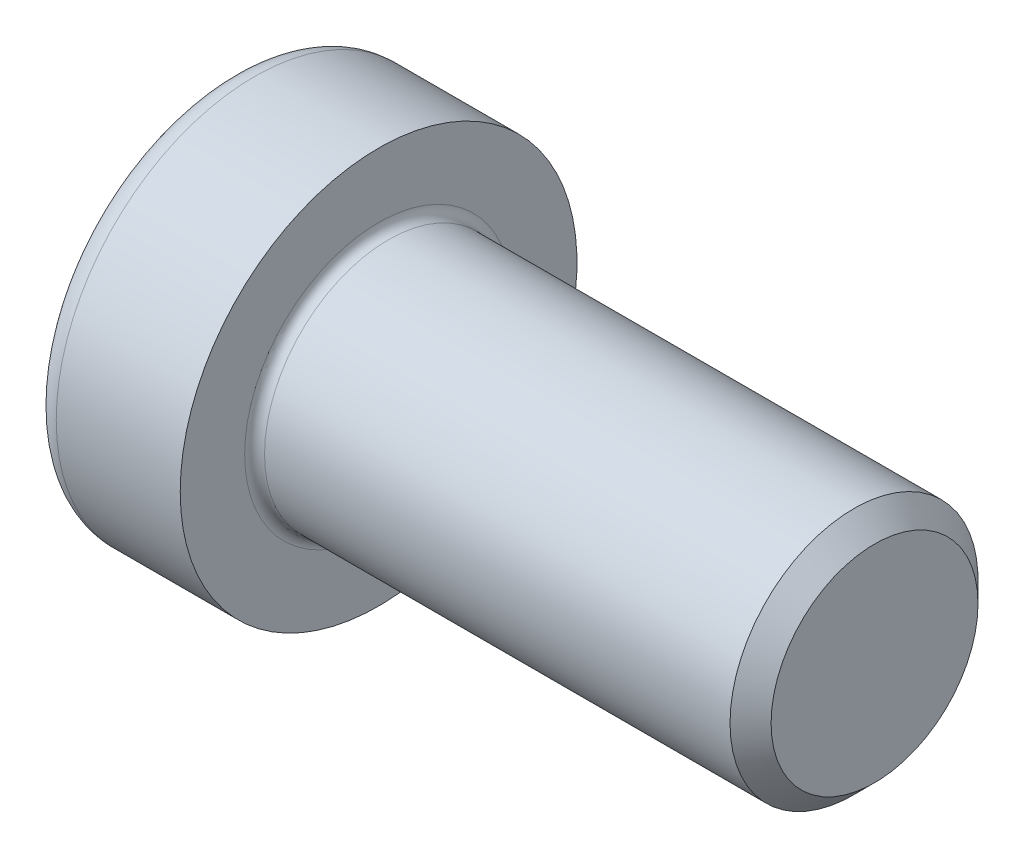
ISO-10303-21;
HEADER;
FILE_DESCRIPTION(('STEP AP214'),'2;1');
FILE_NAME('part.step','',(''),(''),'','','');
FILE_SCHEMA(('AUTOMOTIVE_DESIGN { 1 0 10303 214 1 1 1 1 }'));
ENDSEC;
DATA;
#1=APPLICATION_CONTEXT('core data for automotive mechanical design processes');
#2=APPLICATION_PROTOCOL_DEFINITION('international standard','automotive_design',2000,#1);
#3=PRODUCT_CONTEXT('',#1,'mechanical');
#4=PRODUCT('Part','Part','',(#3));
#5=PRODUCT_RELATED_PRODUCT_CATEGORY('part','',(#4));
#6=PRODUCT_DEFINITION_FORMATION('','',#4);
#7=PRODUCT_DEFINITION_CONTEXT('part definition',#1,'design');
#8=PRODUCT_DEFINITION('design','',#6,#7);
#9=PRODUCT_DEFINITION_SHAPE('','',#8);
#10=(LENGTH_UNIT() NAMED_UNIT(*) SI_UNIT(.MILLI.,.METRE.));
#11=(NAMED_UNIT(*) PLANE_ANGLE_UNIT() SI_UNIT($,.RADIAN.));
#12=(NAMED_UNIT(*) SI_UNIT($,.STERADIAN.) SOLID_ANGLE_UNIT());
#13=UNCERTAINTY_MEASURE_WITH_UNIT(LENGTH_MEASURE(1.E-05),#10,'distance_accuracy_value','');
#14=(GEOMETRIC_REPRESENTATION_CONTEXT(3) GLOBAL_UNCERTAINTY_ASSIGNED_CONTEXT((#13)) GLOBAL_UNIT_ASSIGNED_CONTEXT((#10,
#11,#12)) REPRESENTATION_CONTEXT('',''));
#15=CARTESIAN_POINT('',(0.,0.,0.));
#16=DIRECTION('',(0.,0.,1.));
#17=DIRECTION('',(1.,0.,0.));
#18=AXIS2_PLACEMENT_3D('',#15,#16,#17);
#19=CARTESIAN_POINT('',(0.,0.,0.));
#20=DIRECTION('',(-1.,0.,0.));
#21=DIRECTION('',(0.,0.,1.));
#22=AXIS2_PLACEMENT_3D('',#19,#20,#21);
#23=PLANE('',#22);
#24=DIRECTION('',(0.,-0.499999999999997,0.86602540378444));
#25=VECTOR('',#24,1.);
#26=CARTESIAN_POINT('',(0.,4.04145188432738,0.));
#27=LINE('',#26,#25);
#28=CARTESIAN_POINT('',(0.,4.04145188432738,0.));
#29=VERTEX_POINT('',#28);
#30=CARTESIAN_POINT('',(0.,2.0207259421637,3.49999999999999));
#31=VERTEX_POINT('',#30);
#32=EDGE_CURVE('E286',#29,#31,#27,.T.);
#33=ORIENTED_EDGE('',*,*,#32,.T.);
#34=DIRECTION('',(0.,1.,0.));
#35=VECTOR('',#34,1.);
#36=CARTESIAN_POINT('',(0.,-2.02072594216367,3.5));
#37=LINE('',#36,#35);
#38=CARTESIAN_POINT('',(0.,-2.02072594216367,3.5));
#39=VERTEX_POINT('',#38);
#40=EDGE_CURVE('E143',#39,#31,#37,.T.);
#41=ORIENTED_EDGE('',*,*,#40,.F.);
#42=DIRECTION('',(0.,-0.500000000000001,-0.866025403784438));
#43=VECTOR('',#42,1.);
#44=CARTESIAN_POINT('',(0.,-2.02072594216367,3.5));
#45=LINE('',#44,#43);
#46=CARTESIAN_POINT('',(0.,-4.04145188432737,0.));
#47=VERTEX_POINT('',#46);
#48=EDGE_CURVE('E291',#39,#47,#45,.T.);
#49=ORIENTED_EDGE('',*,*,#48,.T.);
#50=DIRECTION('',(0.,0.499999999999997,-0.86602540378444));
#51=VECTOR('',#50,1.);
#52=CARTESIAN_POINT('',(0.,-4.04145188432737,0.));
#53=LINE('',#52,#51);
#54=CARTESIAN_POINT('',(0.,-2.02072594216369,-3.5));
#55=VERTEX_POINT('',#54);
#56=EDGE_CURVE('E295',#47,#55,#53,.T.);
#57=ORIENTED_EDGE('',*,*,#56,.T.);
#58=DIRECTION('',(0.,-1.,0.));
#59=VECTOR('',#58,1.);
#60=CARTESIAN_POINT('',(0.,2.02072594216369,-3.50000000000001));
#61=LINE('',#60,#59);
#62=CARTESIAN_POINT('',(0.,2.02072594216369,-3.50000000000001));
#63=VERTEX_POINT('',#62);
#64=EDGE_CURVE('E299',#63,#55,#61,.T.);
#65=ORIENTED_EDGE('',*,*,#64,.F.);
#66=DIRECTION('',(0.,-0.500000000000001,-0.866025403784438));
#67=VECTOR('',#66,1.);
#68=CARTESIAN_POINT('',(0.,4.04145188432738,0.));
#69=LINE('',#68,#67);
#70=EDGE_CURVE('E138',#29,#63,#69,.T.);
#71=ORIENTED_EDGE('',*,*,#70,.F.);
#72=EDGE_LOOP('',(#33,#41,#49,#57,#65,#71));
#73=FACE_BOUND('',#72,.T.);
#74=CARTESIAN_POINT('',(0.,0.,0.));
#75=DIRECTION('',(-1.,0.,0.));
#76=DIRECTION('',(0.,0.,1.));
#77=AXIS2_PLACEMENT_3D('',#74,#75,#76);
#78=CIRCLE('',#77,7.);
#79=CARTESIAN_POINT('',(0.,0.,7.));
#80=VERTEX_POINT('',#79);
#81=EDGE_CURVE('E53',#80,#80,#78,.T.);
#82=ORIENTED_EDGE('',*,*,#81,.T.);
#83=EDGE_LOOP('',(#82));
#84=FACE_BOUND('',#83,.T.);
#85=ADVANCED_FACE('F44',(#73,#84),#23,.T.);
#86=CARTESIAN_POINT('',(-31.75,0.,0.));
#87=DIRECTION('',(-1.,0.,0.));
#88=DIRECTION('',(0.,0.,1.));
#89=AXIS2_PLACEMENT_3D('',#86,#87,#88);
#90=CYLINDRICAL_SURFACE('',#89,8.);
#91=CARTESIAN_POINT('',(1.,0.,0.));
#92=DIRECTION('',(-1.,0.,0.));
#93=DIRECTION('',(0.,0.,1.));
#94=AXIS2_PLACEMENT_3D('',#91,#92,#93);
#95=CIRCLE('',#94,8.);
#96=CARTESIAN_POINT('',(1.,0.,8.));
#97=VERTEX_POINT('',#96);
#98=EDGE_CURVE('E11',#97,#97,#95,.F.);
#99=ORIENTED_EDGE('',*,*,#98,.T.);
#100=EDGE_LOOP('',(#99));
#101=FACE_BOUND('',#100,.T.);
#102=CARTESIAN_POINT('',(6.,0.,0.));
#103=DIRECTION('',(-1.,0.,0.));
#104=DIRECTION('',(0.,0.,1.));
#105=AXIS2_PLACEMENT_3D('',#102,#103,#104);
#106=CIRCLE('',#105,8.);
#107=CARTESIAN_POINT('',(6.,0.,8.));
#108=VERTEX_POINT('',#107);
#109=EDGE_CURVE('E167',#108,#108,#106,.T.);
#110=ORIENTED_EDGE('',*,*,#109,.T.);
#111=EDGE_LOOP('',(#110));
#112=FACE_BOUND('',#111,.T.);
#113=ADVANCED_FACE('F195',(#101,#112),#90,.T.);
#114=CARTESIAN_POINT('',(6.,8.,0.));
#115=DIRECTION('',(1.,0.,0.));
#116=DIRECTION('',(0.,0.,-1.));
#117=AXIS2_PLACEMENT_3D('',#114,#115,#116);
#118=PLANE('',#117);
#119=CARTESIAN_POINT('',(6.,0.,0.));
#120=DIRECTION('',(1.,0.,0.));
#121=DIRECTION('',(0.,0.,-1.));
#122=AXIS2_PLACEMENT_3D('',#119,#120,#121);
#123=CIRCLE('',#122,5.39999999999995);
#124=CARTESIAN_POINT('',(6.,0.,-5.39999999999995));
#125=VERTEX_POINT('',#124);
#126=EDGE_CURVE('E171',#125,#125,#123,.F.);
#127=ORIENTED_EDGE('',*,*,#126,.T.);
#128=EDGE_LOOP('',(#127));
#129=FACE_BOUND('',#128,.T.);
#130=ORIENTED_EDGE('',*,*,#109,.F.);
#131=EDGE_LOOP('',(#130));
#132=FACE_BOUND('',#131,.T.);
#133=ADVANCED_FACE('F201',(#129,#132),#118,.T.);
#134=CARTESIAN_POINT('',(-31.75,0.,0.));
#135=DIRECTION('',(-1.,0.,0.));
#136=DIRECTION('',(0.,0.,1.));
#137=AXIS2_PLACEMENT_3D('',#134,#135,#136);
#138=CYLINDRICAL_SURFACE('',#137,4.99999999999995);
#139=CARTESIAN_POINT('',(6.4,0.,0.));
#140=DIRECTION('',(1.,0.,0.));
#141=DIRECTION('',(0.,0.,-1.));
#142=AXIS2_PLACEMENT_3D('',#139,#140,#141);
#143=CIRCLE('',#142,4.99999999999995);
#144=CARTESIAN_POINT('',(6.4,0.,-4.99999999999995));
#145=VERTEX_POINT('',#144);
#146=EDGE_CURVE('E175',#145,#145,#143,.T.);
#147=ORIENTED_EDGE('',*,*,#146,.T.);
#148=EDGE_LOOP('',(#147));
#149=FACE_BOUND('',#148,.T.);
#150=CARTESIAN_POINT('',(25.1719999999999,0.,0.));
#151=DIRECTION('',(-1.,0.,0.));
#152=DIRECTION('',(0.,0.,1.));
#153=AXIS2_PLACEMENT_3D('',#150,#151,#152);
#154=CIRCLE('',#153,4.99999999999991);
#155=CARTESIAN_POINT('',(25.1719999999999,0.,4.99999999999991));
#156=VERTEX_POINT('',#155);
#157=EDGE_CURVE('E163',#156,#156,#154,.T.);
#158=ORIENTED_EDGE('',*,*,#157,.T.);
#159=EDGE_LOOP('',(#158));
#160=FACE_BOUND('',#159,.T.);
#161=ADVANCED_FACE('F207',(#149,#160),#138,.T.);
#162=CARTESIAN_POINT('',(26.,0.,0.));
#163=DIRECTION('',(-1.,0.,0.));
#164=DIRECTION('',(0.,0.,1.));
#165=AXIS2_PLACEMENT_3D('',#162,#163,#164);
#166=CONICAL_SURFACE('',#165,4.172,0.785398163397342);
#167=ORIENTED_EDGE('',*,*,#157,.F.);
#168=EDGE_LOOP('',(#167));
#169=FACE_BOUND('',#168,.T.);
#170=CARTESIAN_POINT('',(26.,0.,0.));
#171=DIRECTION('',(-1.,0.,0.));
#172=DIRECTION('',(0.,0.,1.));
#173=AXIS2_PLACEMENT_3D('',#170,#171,#172);
#174=CIRCLE('',#173,4.172);
#175=CARTESIAN_POINT('',(26.,0.,4.172));
#176=VERTEX_POINT('',#175);
#177=EDGE_CURVE('E158',#176,#176,#174,.T.);
#178=ORIENTED_EDGE('',*,*,#177,.T.);
#179=EDGE_LOOP('',(#178));
#180=FACE_BOUND('',#179,.T.);
#181=ADVANCED_FACE('F211',(#169,#180),#166,.T.);
#182=CARTESIAN_POINT('',(26.,4.172,0.));
#183=DIRECTION('',(1.,0.,0.));
#184=DIRECTION('',(0.,0.,-1.));
#185=AXIS2_PLACEMENT_3D('',#182,#183,#184);
#186=PLANE('',#185);
#187=ORIENTED_EDGE('',*,*,#177,.F.);
#188=EDGE_LOOP('',(#187));
#189=FACE_BOUND('',#188,.T.);
#190=ADVANCED_FACE('F191',(#189),#186,.T.);
#191=CARTESIAN_POINT('',(6.4,0.,0.));
#192=DIRECTION('',(1.,0.,0.));
#193=DIRECTION('',(0.,0.,-1.));
#194=AXIS2_PLACEMENT_3D('',#191,#192,#193);
#195=TOROIDAL_SURFACE('',#194,5.39999999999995,0.4);
#196=ORIENTED_EDGE('',*,*,#146,.F.);
#197=EDGE_LOOP('',(#196));
#198=FACE_BOUND('',#197,.T.);
#199=ORIENTED_EDGE('',*,*,#126,.F.);
#200=EDGE_LOOP('',(#199));
#201=FACE_BOUND('',#200,.T.);
#202=ADVANCED_FACE('F184',(#198,#201),#195,.F.);
#203=CARTESIAN_POINT('',(1.,0.,0.));
#204=DIRECTION('',(-1.,0.,0.));
#205=DIRECTION('',(0.,0.,1.));
#206=AXIS2_PLACEMENT_3D('',#203,#204,#205);
#207=TOROIDAL_SURFACE('',#206,7.,1.);
#208=ORIENTED_EDGE('',*,*,#98,.F.);
#209=EDGE_LOOP('',(#208));
#210=FACE_BOUND('',#209,.T.);
#211=ORIENTED_EDGE('',*,*,#81,.F.);
#212=EDGE_LOOP('',(#211));
#213=FACE_BOUND('',#212,.T.);
#214=ADVANCED_FACE('F46',(#210,#213),#207,.T.);
#215=CARTESIAN_POINT('',(4.5,4.04145188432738,0.));
#216=DIRECTION('',(0.,-0.86602540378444,-0.499999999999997));
#217=DIRECTION('',(0.,0.499999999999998,-0.86602540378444));
#218=AXIS2_PLACEMENT_3D('',#215,#216,#217);
#219=PLANE('',#218);
#220=ORIENTED_EDGE('',*,*,#32,.F.);
#221=DIRECTION('',(-1.,0.,0.));
#222=VECTOR('',#221,1.);
#223=CARTESIAN_POINT('',(4.5,4.04145188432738,0.));
#224=LINE('',#223,#222);
#225=CARTESIAN_POINT('',(4.5,4.04145188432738,0.));
#226=VERTEX_POINT('',#225);
#227=EDGE_CURVE('E273',#226,#29,#224,.T.);
#228=ORIENTED_EDGE('',*,*,#227,.F.);
#229=DIRECTION('',(0.,-0.499999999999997,0.86602540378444));
#230=VECTOR('',#229,1.);
#231=CARTESIAN_POINT('',(4.5,4.04145188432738,0.));
#232=LINE('',#231,#230);
#233=CARTESIAN_POINT('',(4.5,3.03108891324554,1.74999999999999));
#234=VERTEX_POINT('',#233);
#235=EDGE_CURVE('E129',#226,#234,#232,.T.);
#236=ORIENTED_EDGE('',*,*,#235,.T.);
#237=CARTESIAN_POINT('',(4.5,2.0207259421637,3.49999999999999));
#238=VERTEX_POINT('',#237);
#239=EDGE_CURVE('E119',#234,#238,#232,.T.);
#240=ORIENTED_EDGE('',*,*,#239,.T.);
#241=DIRECTION('',(-1.,0.,0.));
#242=VECTOR('',#241,1.);
#243=CARTESIAN_POINT('',(4.5,2.0207259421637,3.49999999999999));
#244=LINE('',#243,#242);
#245=EDGE_CURVE('E134',#238,#31,#244,.T.);
#246=ORIENTED_EDGE('',*,*,#245,.T.);
#247=EDGE_LOOP('',(#220,#228,#236,#240,#246));
#248=FACE_BOUND('',#247,.T.);
#249=ADVANCED_FACE('F133',(#248),#219,.T.);
#250=CARTESIAN_POINT('',(4.5,-2.02072594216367,3.5));
#251=DIRECTION('',(0.,0.,1.));
#252=DIRECTION('',(0.,-1.,0.));
#253=AXIS2_PLACEMENT_3D('',#250,#251,#252);
#254=PLANE('',#253);
#255=ORIENTED_EDGE('',*,*,#40,.T.);
#256=ORIENTED_EDGE('',*,*,#245,.F.);
#257=DIRECTION('',(0.,1.,0.));
#258=VECTOR('',#257,1.);
#259=CARTESIAN_POINT('',(4.5,-2.02072594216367,3.5));
#260=LINE('',#259,#258);
#261=CARTESIAN_POINT('',(4.5,0.,3.5));
#262=VERTEX_POINT('',#261);
#263=EDGE_CURVE('E116',#262,#238,#260,.T.);
#264=ORIENTED_EDGE('',*,*,#263,.F.);
#265=CARTESIAN_POINT('',(4.5,-2.02072594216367,3.5));
#266=VERTEX_POINT('',#265);
#267=EDGE_CURVE('E128',#266,#262,#260,.T.);
#268=ORIENTED_EDGE('',*,*,#267,.F.);
#269=DIRECTION('',(-1.,0.,0.));
#270=VECTOR('',#269,1.);
#271=CARTESIAN_POINT('',(4.5,-2.02072594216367,3.5));
#272=LINE('',#271,#270);
#273=EDGE_CURVE('E146',#266,#39,#272,.T.);
#274=ORIENTED_EDGE('',*,*,#273,.T.);
#275=EDGE_LOOP('',(#255,#256,#264,#268,#274));
#276=FACE_BOUND('',#275,.T.);
#277=ADVANCED_FACE('F140',(#276),#254,.F.);
#278=CARTESIAN_POINT('',(4.5,-2.02072594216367,3.5));
#279=DIRECTION('',(0.,0.866025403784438,-0.500000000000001));
#280=DIRECTION('',(0.,0.500000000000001,0.866025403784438));
#281=AXIS2_PLACEMENT_3D('',#278,#279,#280);
#282=PLANE('',#281);
#283=ORIENTED_EDGE('',*,*,#48,.F.);
#284=ORIENTED_EDGE('',*,*,#273,.F.);
#285=DIRECTION('',(0.,-0.500000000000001,-0.866025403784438));
#286=VECTOR('',#285,1.);
#287=CARTESIAN_POINT('',(4.5,-2.02072594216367,3.5));
#288=LINE('',#287,#286);
#289=CARTESIAN_POINT('',(4.5,-3.03108891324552,1.75));
#290=VERTEX_POINT('',#289);
#291=EDGE_CURVE('E329',#266,#290,#288,.T.);
#292=ORIENTED_EDGE('',*,*,#291,.T.);
#293=CARTESIAN_POINT('',(4.5,-4.04145188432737,0.));
#294=VERTEX_POINT('',#293);
#295=EDGE_CURVE('E313',#290,#294,#288,.T.);
#296=ORIENTED_EDGE('',*,*,#295,.T.);
#297=DIRECTION('',(-1.,0.,0.));
#298=VECTOR('',#297,1.);
#299=CARTESIAN_POINT('',(4.5,-4.04145188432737,0.));
#300=LINE('',#299,#298);
#301=EDGE_CURVE('E153',#294,#47,#300,.T.);
#302=ORIENTED_EDGE('',*,*,#301,.T.);
#303=EDGE_LOOP('',(#283,#284,#292,#296,#302));
#304=FACE_BOUND('',#303,.T.);
#305=ADVANCED_FACE('F225',(#304),#282,.T.);
#306=CARTESIAN_POINT('',(4.5,-4.04145188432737,0.));
#307=DIRECTION('',(0.,0.86602540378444,0.499999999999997));
#308=DIRECTION('',(0.,-0.499999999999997,0.86602540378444));
#309=AXIS2_PLACEMENT_3D('',#306,#307,#308);
#310=PLANE('',#309);
#311=ORIENTED_EDGE('',*,*,#56,.F.);
#312=ORIENTED_EDGE('',*,*,#301,.F.);
#313=DIRECTION('',(0.,0.499999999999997,-0.86602540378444));
#314=VECTOR('',#313,1.);
#315=CARTESIAN_POINT('',(4.5,-4.04145188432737,0.));
#316=LINE('',#315,#314);
#317=CARTESIAN_POINT('',(4.5,-3.03108891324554,-1.74999999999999));
#318=VERTEX_POINT('',#317);
#319=EDGE_CURVE('E281',#294,#318,#316,.T.);
#320=ORIENTED_EDGE('',*,*,#319,.T.);
#321=CARTESIAN_POINT('',(4.5,-2.02072594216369,-3.5));
#322=VERTEX_POINT('',#321);
#323=EDGE_CURVE('E327',#318,#322,#316,.T.);
#324=ORIENTED_EDGE('',*,*,#323,.T.);
#325=DIRECTION('',(-1.,0.,0.));
#326=VECTOR('',#325,1.);
#327=CARTESIAN_POINT('',(4.5,-2.02072594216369,-3.5));
#328=LINE('',#327,#326);
#329=EDGE_CURVE('E272',#322,#55,#328,.T.);
#330=ORIENTED_EDGE('',*,*,#329,.T.);
#331=EDGE_LOOP('',(#311,#312,#320,#324,#330));
#332=FACE_BOUND('',#331,.T.);
#333=ADVANCED_FACE('F228',(#332),#310,.T.);
#334=CARTESIAN_POINT('',(4.5,2.02072594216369,-3.50000000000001));
#335=DIRECTION('',(0.,0.,-1.));
#336=DIRECTION('',(0.,1.,0.));
#337=AXIS2_PLACEMENT_3D('',#334,#335,#336);
#338=PLANE('',#337);
#339=ORIENTED_EDGE('',*,*,#64,.T.);
#340=ORIENTED_EDGE('',*,*,#329,.F.);
#341=DIRECTION('',(0.,-1.,0.));
#342=VECTOR('',#341,1.);
#343=CARTESIAN_POINT('',(4.5,2.02072594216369,-3.50000000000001));
#344=LINE('',#343,#342);
#345=CARTESIAN_POINT('',(4.5,0.,-3.5));
#346=VERTEX_POINT('',#345);
#347=EDGE_CURVE('E276',#346,#322,#344,.T.);
#348=ORIENTED_EDGE('',*,*,#347,.F.);
#349=CARTESIAN_POINT('',(4.5,2.02072594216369,-3.50000000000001));
#350=VERTEX_POINT('',#349);
#351=EDGE_CURVE('E60',#350,#346,#344,.T.);
#352=ORIENTED_EDGE('',*,*,#351,.F.);
#353=DIRECTION('',(-1.,0.,0.));
#354=VECTOR('',#353,1.);
#355=CARTESIAN_POINT('',(4.5,2.02072594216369,-3.50000000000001));
#356=LINE('',#355,#354);
#357=EDGE_CURVE('E268',#350,#63,#356,.T.);
#358=ORIENTED_EDGE('',*,*,#357,.T.);
#359=EDGE_LOOP('',(#339,#340,#348,#352,#358));
#360=FACE_BOUND('',#359,.T.);
#361=ADVANCED_FACE('F232',(#360),#338,.F.);
#362=CARTESIAN_POINT('',(4.5,4.04145188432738,0.));
#363=DIRECTION('',(0.,0.866025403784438,-0.500000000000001));
#364=DIRECTION('',(0.,0.500000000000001,0.866025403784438));
#365=AXIS2_PLACEMENT_3D('',#362,#363,#364);
#366=PLANE('',#365);
#367=ORIENTED_EDGE('',*,*,#70,.T.);
#368=ORIENTED_EDGE('',*,*,#357,.F.);
#369=DIRECTION('',(0.,-0.500000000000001,-0.866025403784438));
#370=VECTOR('',#369,1.);
#371=CARTESIAN_POINT('',(4.5,4.04145188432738,0.));
#372=LINE('',#371,#370);
#373=CARTESIAN_POINT('',(4.5,3.03108891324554,-1.75000000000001));
#374=VERTEX_POINT('',#373);
#375=EDGE_CURVE('E257',#374,#350,#372,.T.);
#376=ORIENTED_EDGE('',*,*,#375,.F.);
#377=EDGE_CURVE('E264',#226,#374,#372,.T.);
#378=ORIENTED_EDGE('',*,*,#377,.F.);
#379=ORIENTED_EDGE('',*,*,#227,.T.);
#380=EDGE_LOOP('',(#367,#368,#376,#378,#379));
#381=FACE_BOUND('',#380,.T.);
#382=ADVANCED_FACE('F236',(#381),#366,.F.);
#383=CARTESIAN_POINT('',(4.5,6.06217782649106,-3.50000000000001));
#384=DIRECTION('',(1.,0.,0.));
#385=DIRECTION('',(0.,0.,-1.));
#386=AXIS2_PLACEMENT_3D('',#383,#384,#385);
#387=PLANE('',#386);
#388=ORIENTED_EDGE('',*,*,#347,.T.);
#389=ORIENTED_EDGE('',*,*,#323,.F.);
#390=CARTESIAN_POINT('',(4.5,0.,0.));
#391=DIRECTION('',(-1.,0.,0.));
#392=DIRECTION('',(0.,0.,1.));
#393=AXIS2_PLACEMENT_3D('',#390,#391,#392);
#394=CIRCLE('',#393,3.5);
#395=EDGE_CURVE('E321',#346,#318,#394,.T.);
#396=ORIENTED_EDGE('',*,*,#395,.F.);
#397=EDGE_LOOP('',(#388,#389,#396));
#398=FACE_BOUND('',#397,.T.);
#399=ADVANCED_FACE('F240',(#398),#387,.F.);
#400=ORIENTED_EDGE('',*,*,#319,.F.);
#401=ORIENTED_EDGE('',*,*,#295,.F.);
#402=EDGE_CURVE('E151',#318,#290,#394,.T.);
#403=ORIENTED_EDGE('',*,*,#402,.F.);
#404=EDGE_LOOP('',(#400,#401,#403));
#405=FACE_BOUND('',#404,.T.);
#406=ADVANCED_FACE('F243',(#405),#387,.F.);
#407=ORIENTED_EDGE('',*,*,#291,.F.);
#408=ORIENTED_EDGE('',*,*,#267,.T.);
#409=EDGE_CURVE('E145',#290,#262,#394,.T.);
#410=ORIENTED_EDGE('',*,*,#409,.F.);
#411=EDGE_LOOP('',(#407,#408,#410));
#412=FACE_BOUND('',#411,.T.);
#413=ADVANCED_FACE('F248',(#412),#387,.F.);
#414=ORIENTED_EDGE('',*,*,#263,.T.);
#415=ORIENTED_EDGE('',*,*,#239,.F.);
#416=EDGE_CURVE('E122',#262,#234,#394,.T.);
#417=ORIENTED_EDGE('',*,*,#416,.F.);
#418=EDGE_LOOP('',(#414,#415,#417));
#419=FACE_BOUND('',#418,.T.);
#420=ADVANCED_FACE('F118',(#419),#387,.F.);
#421=ORIENTED_EDGE('',*,*,#235,.F.);
#422=ORIENTED_EDGE('',*,*,#377,.T.);
#423=EDGE_CURVE('E159',#234,#374,#394,.T.);
#424=ORIENTED_EDGE('',*,*,#423,.F.);
#425=EDGE_LOOP('',(#421,#422,#424));
#426=FACE_BOUND('',#425,.T.);
#427=ADVANCED_FACE('F251',(#426),#387,.F.);
#428=ORIENTED_EDGE('',*,*,#375,.T.);
#429=ORIENTED_EDGE('',*,*,#351,.T.);
#430=EDGE_CURVE('E260',#374,#346,#394,.T.);
#431=ORIENTED_EDGE('',*,*,#430,.F.);
#432=EDGE_LOOP('',(#428,#429,#431));
#433=FACE_BOUND('',#432,.T.);
#434=ADVANCED_FACE('F221',(#433),#387,.F.);
#435=CARTESIAN_POINT('',(4.5,0.,0.));
#436=DIRECTION('',(-1.,0.,0.));
#437=DIRECTION('',(0.,0.,1.));
#438=AXIS2_PLACEMENT_3D('',#435,#436,#437);
#439=CONICAL_SURFACE('',#438,3.5,1.04719755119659);
#440=CARTESIAN_POINT('',(6.52072594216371,0.,0.));
#441=VERTEX_POINT('',#440);
#442=VERTEX_LOOP('',#441);
#443=FACE_BOUND('',#442,.T.);
#444=ORIENTED_EDGE('',*,*,#416,.T.);
#445=ORIENTED_EDGE('',*,*,#423,.T.);
#446=ORIENTED_EDGE('',*,*,#430,.T.);
#447=ORIENTED_EDGE('',*,*,#395,.T.);
#448=ORIENTED_EDGE('',*,*,#402,.T.);
#449=ORIENTED_EDGE('',*,*,#409,.T.);
#450=EDGE_LOOP('',(#444,#445,#446,#447,#448,#449));
#451=FACE_BOUND('',#450,.T.);
#452=ADVANCED_FACE('F219',(#443,#451),#439,.F.);
#453=CLOSED_SHELL('',(#85,#113,#133,#161,#181,#190,#202,#214,#249,#277,#305,#333,#361,#382,#399,
#406,#413,#420,#427,#434,#452));
#454=MANIFOLD_SOLID_BREP('B2',#453);
#455=ADVANCED_BREP_SHAPE_REPRESENTATION('',(#18,#454),#14);
#456=SHAPE_DEFINITION_REPRESENTATION(#9,#455);
ENDSEC;
END-ISO-10303-21;
